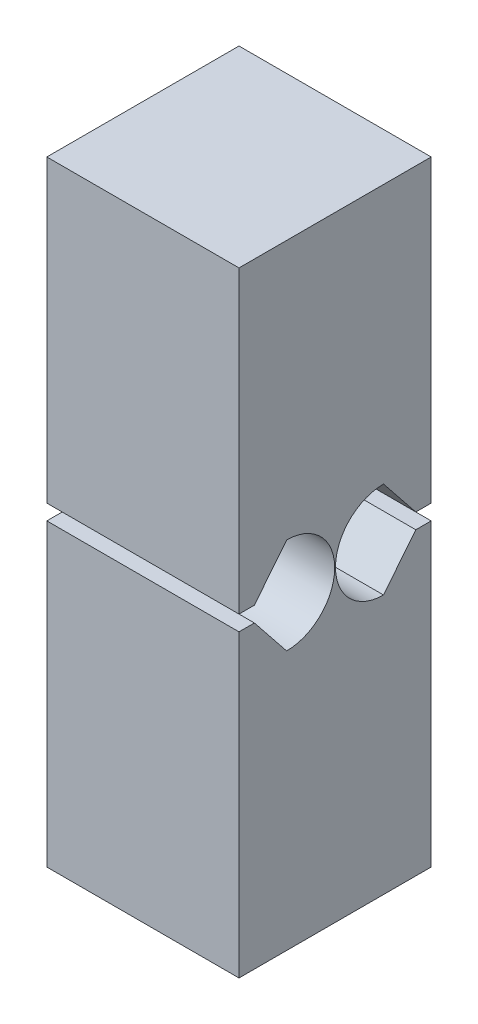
from build123d import *

# Parameters (mm, degrees)
SKETCH1_W           = 6.35
SKETCH1_H           = 6.35
BOSS_EXTRUDE1_DEPTH = 10.16
CUT_EXTRUDE1_REACH  = 14.395


with BuildPart() as part:
    # Sketch1 → Boss-Extrude1 (new, symmetric)
    with BuildSketch(Plane(origin=(0, 0, 0), x_dir=(1, 0, 0), z_dir=(0, 1, 0))):
        Rectangle(SKETCH1_W, SKETCH1_H)
    extrude(amount=BOSS_EXTRUDE1_DEPTH, both=True)

    # Sketch2 → Cut-Extrude1 (cut, up to next)
    with BuildSketch(Plane(origin=(3.175, 0, 0), x_dir=(0, 0, -1), z_dir=(1, 0, 0)), mode=Mode.PRIVATE) as cut_extrude1_sk1:
        with BuildLine():
            Line((-3.175, 0.254), (-3.175, -0.254))
            Line((-3.175, -0.254), (-2.667, -0.254))
            Line((-2.667, -0.254), (-1.6002, -1.5875))
            ThreePointArc((-1.6002, -1.5875), (-0.0127, 0), (-1.6002, 1.5875))
            Line((-1.6002, 1.5875), (-2.667, 0.254))
            Line((-2.667, 0.254), (-3.175, 0.254))
        make_face()
    cut_extrude1_tool1 = extrude(cut_extrude1_sk1.sketch, amount=-CUT_EXTRUDE1_REACH, mode=Mode.PRIVATE) & part.part
    cut_extrude1 = cut_extrude1_tool1.solids().sort_by_distance((3.175, 0, 1.352453))[0]
    add(cut_extrude1, mode=Mode.SUBTRACT)

    # Mirror1: Cut-Extrude1 across plane
    add(cut_extrude1.mirror(Plane.XY), mode=Mode.SUBTRACT)


solid = part.part
